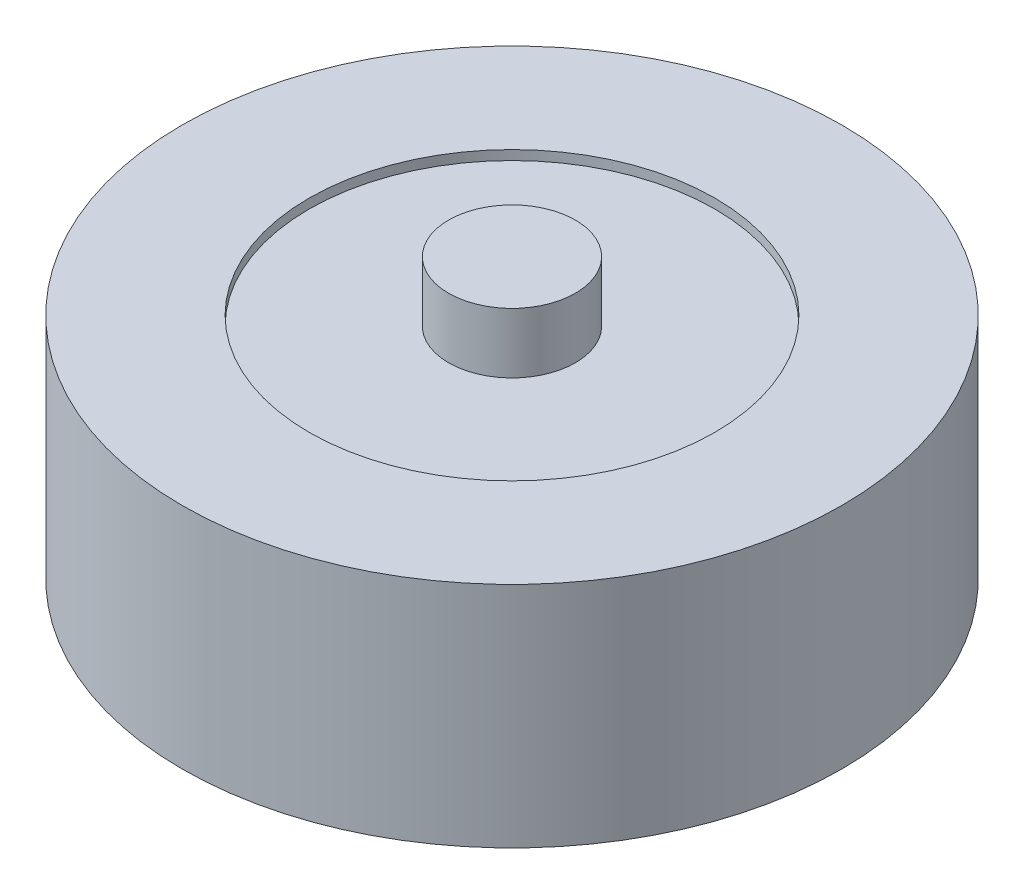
ISO-10303-21;
HEADER;
FILE_DESCRIPTION(('STEP AP214'),'2;1');
FILE_NAME('part.step','',(''),(''),'','','');
FILE_SCHEMA(('AUTOMOTIVE_DESIGN { 1 0 10303 214 1 1 1 1 }'));
ENDSEC;
DATA;
#1=APPLICATION_CONTEXT('core data for automotive mechanical design processes');
#2=APPLICATION_PROTOCOL_DEFINITION('international standard','automotive_design',2000,#1);
#3=PRODUCT_CONTEXT('',#1,'mechanical');
#4=PRODUCT('Part','Part','',(#3));
#5=PRODUCT_RELATED_PRODUCT_CATEGORY('part','',(#4));
#6=PRODUCT_DEFINITION_FORMATION('','',#4);
#7=PRODUCT_DEFINITION_CONTEXT('part definition',#1,'design');
#8=PRODUCT_DEFINITION('design','',#6,#7);
#9=PRODUCT_DEFINITION_SHAPE('','',#8);
#10=(LENGTH_UNIT() NAMED_UNIT(*) SI_UNIT(.MILLI.,.METRE.));
#11=(NAMED_UNIT(*) PLANE_ANGLE_UNIT() SI_UNIT($,.RADIAN.));
#12=(NAMED_UNIT(*) SI_UNIT($,.STERADIAN.) SOLID_ANGLE_UNIT());
#13=UNCERTAINTY_MEASURE_WITH_UNIT(LENGTH_MEASURE(1.E-05),#10,'distance_accuracy_value','');
#14=(GEOMETRIC_REPRESENTATION_CONTEXT(3) GLOBAL_UNCERTAINTY_ASSIGNED_CONTEXT((#13)) GLOBAL_UNIT_ASSIGNED_CONTEXT((#10,
#11,#12)) REPRESENTATION_CONTEXT('',''));
#15=CARTESIAN_POINT('',(0.,0.,0.));
#16=DIRECTION('',(0.,0.,1.));
#17=DIRECTION('',(1.,0.,0.));
#18=AXIS2_PLACEMENT_3D('',#15,#16,#17);
#19=CARTESIAN_POINT('',(0.,17.25,0.));
#20=DIRECTION('',(0.,1.,0.));
#21=DIRECTION('',(0.,0.,1.));
#22=AXIS2_PLACEMENT_3D('',#19,#20,#21);
#23=PLANE('',#22);
#24=CARTESIAN_POINT('',(0.,17.25,0.));
#25=DIRECTION('',(0.,1.,0.));
#26=DIRECTION('',(0.,0.,1.));
#27=AXIS2_PLACEMENT_3D('',#24,#25,#26);
#28=CIRCLE('',#27,16.);
#29=CARTESIAN_POINT('',(0.,17.25,16.));
#30=VERTEX_POINT('',#29);
#31=EDGE_CURVE('E93',#30,#30,#28,.T.);
#32=ORIENTED_EDGE('',*,*,#31,.T.);
#33=EDGE_LOOP('',(#32));
#34=FACE_BOUND('',#33,.T.);
#35=CARTESIAN_POINT('',(0.,17.25,0.));
#36=DIRECTION('',(0.,1.,0.));
#37=DIRECTION('',(0.,0.,1.));
#38=AXIS2_PLACEMENT_3D('',#35,#36,#37);
#39=CIRCLE('',#38,5.);
#40=CARTESIAN_POINT('',(0.,17.25,5.));
#41=VERTEX_POINT('',#40);
#42=EDGE_CURVE('E86',#41,#41,#39,.T.);
#43=ORIENTED_EDGE('',*,*,#42,.F.);
#44=EDGE_LOOP('',(#43));
#45=FACE_BOUND('',#44,.T.);
#46=ADVANCED_FACE('F32',(#34,#45),#23,.T.);
#47=CARTESIAN_POINT('',(0.,18.,0.));
#48=DIRECTION('',(0.,-1.,0.));
#49=DIRECTION('',(0.,0.,-1.));
#50=AXIS2_PLACEMENT_3D('',#47,#48,#49);
#51=CYLINDRICAL_SURFACE('',#50,26.);
#52=CARTESIAN_POINT('',(0.,18.,0.));
#53=DIRECTION('',(0.,1.,0.));
#54=DIRECTION('',(0.,0.,1.));
#55=AXIS2_PLACEMENT_3D('',#52,#53,#54);
#56=CIRCLE('',#55,26.);
#57=CARTESIAN_POINT('',(0.,18.,26.));
#58=VERTEX_POINT('',#57);
#59=EDGE_CURVE('E11',#58,#58,#56,.T.);
#60=ORIENTED_EDGE('',*,*,#59,.F.);
#61=EDGE_LOOP('',(#60));
#62=FACE_BOUND('',#61,.T.);
#63=CARTESIAN_POINT('',(0.,0.,0.));
#64=DIRECTION('',(0.,1.,0.));
#65=DIRECTION('',(0.,0.,1.));
#66=AXIS2_PLACEMENT_3D('',#63,#64,#65);
#67=CIRCLE('',#66,26.);
#68=CARTESIAN_POINT('',(0.,0.,26.));
#69=VERTEX_POINT('',#68);
#70=EDGE_CURVE('E36',#69,#69,#67,.T.);
#71=ORIENTED_EDGE('',*,*,#70,.T.);
#72=EDGE_LOOP('',(#71));
#73=FACE_BOUND('',#72,.T.);
#74=ADVANCED_FACE('F34',(#62,#73),#51,.T.);
#75=CARTESIAN_POINT('',(0.,18.,0.));
#76=DIRECTION('',(0.,1.,0.));
#77=DIRECTION('',(0.,0.,1.));
#78=AXIS2_PLACEMENT_3D('',#75,#76,#77);
#79=PLANE('',#78);
#80=CARTESIAN_POINT('',(0.,18.,0.));
#81=DIRECTION('',(0.,1.,0.));
#82=DIRECTION('',(0.,0.,1.));
#83=AXIS2_PLACEMENT_3D('',#80,#81,#82);
#84=CIRCLE('',#83,16.);
#85=CARTESIAN_POINT('',(0.,18.,16.));
#86=VERTEX_POINT('',#85);
#87=EDGE_CURVE('E90',#86,#86,#84,.T.);
#88=ORIENTED_EDGE('',*,*,#87,.F.);
#89=EDGE_LOOP('',(#88));
#90=FACE_BOUND('',#89,.T.);
#91=ORIENTED_EDGE('',*,*,#59,.T.);
#92=EDGE_LOOP('',(#91));
#93=FACE_BOUND('',#92,.T.);
#94=ADVANCED_FACE('F101',(#90,#93),#79,.T.);
#95=CARTESIAN_POINT('',(0.,0.,0.));
#96=DIRECTION('',(0.,1.,0.));
#97=DIRECTION('',(0.,0.,1.));
#98=AXIS2_PLACEMENT_3D('',#95,#96,#97);
#99=PLANE('',#98);
#100=CARTESIAN_POINT('',(-15.5563491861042,0.,15.5563491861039));
#101=DIRECTION('',(0.,-1.,0.));
#102=DIRECTION('',(0.,0.,-1.));
#103=AXIS2_PLACEMENT_3D('',#100,#101,#102);
#104=CIRCLE('',#103,2.09999999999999);
#105=CARTESIAN_POINT('',(-15.5563491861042,0.,13.4563491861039));
#106=VERTEX_POINT('',#105);
#107=EDGE_CURVE('E64',#106,#106,#104,.T.);
#108=ORIENTED_EDGE('',*,*,#107,.F.);
#109=EDGE_LOOP('',(#108));
#110=FACE_BOUND('',#109,.T.);
#111=CARTESIAN_POINT('',(15.556349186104,0.,15.5563491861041));
#112=DIRECTION('',(0.,-1.,0.));
#113=DIRECTION('',(0.,0.,-1.));
#114=AXIS2_PLACEMENT_3D('',#111,#112,#113);
#115=CIRCLE('',#114,2.09999999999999);
#116=CARTESIAN_POINT('',(15.556349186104,0.,13.4563491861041));
#117=VERTEX_POINT('',#116);
#118=EDGE_CURVE('E63',#117,#117,#115,.T.);
#119=ORIENTED_EDGE('',*,*,#118,.F.);
#120=EDGE_LOOP('',(#119));
#121=FACE_BOUND('',#120,.T.);
#122=CARTESIAN_POINT('',(15.5563491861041,0.,-15.556349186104));
#123=DIRECTION('',(0.,-1.,0.));
#124=DIRECTION('',(0.,0.,-1.));
#125=AXIS2_PLACEMENT_3D('',#122,#123,#124);
#126=CIRCLE('',#125,2.09999999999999);
#127=CARTESIAN_POINT('',(15.5563491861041,0.,-17.656349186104));
#128=VERTEX_POINT('',#127);
#129=EDGE_CURVE('E74',#128,#128,#126,.T.);
#130=ORIENTED_EDGE('',*,*,#129,.F.);
#131=EDGE_LOOP('',(#130));
#132=FACE_BOUND('',#131,.T.);
#133=CARTESIAN_POINT('',(-15.5563491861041,0.,-15.556349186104));
#134=DIRECTION('',(0.,-1.,0.));
#135=DIRECTION('',(0.,0.,-1.));
#136=AXIS2_PLACEMENT_3D('',#133,#134,#135);
#137=CIRCLE('',#136,2.09999999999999);
#138=CARTESIAN_POINT('',(-15.5563491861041,0.,-17.656349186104));
#139=VERTEX_POINT('',#138);
#140=EDGE_CURVE('E80',#139,#139,#137,.T.);
#141=ORIENTED_EDGE('',*,*,#140,.F.);
#142=EDGE_LOOP('',(#141));
#143=FACE_BOUND('',#142,.T.);
#144=ORIENTED_EDGE('',*,*,#70,.F.);
#145=EDGE_LOOP('',(#144));
#146=FACE_BOUND('',#145,.T.);
#147=ADVANCED_FACE('F104',(#110,#121,#132,#143,#146),#99,.F.);
#148=CARTESIAN_POINT('',(0.,17.25,0.));
#149=DIRECTION('',(0.,1.,0.));
#150=DIRECTION('',(0.,0.,1.));
#151=AXIS2_PLACEMENT_3D('',#148,#149,#150);
#152=CYLINDRICAL_SURFACE('',#151,16.);
#153=ORIENTED_EDGE('',*,*,#31,.F.);
#154=EDGE_LOOP('',(#153));
#155=FACE_BOUND('',#154,.T.);
#156=ORIENTED_EDGE('',*,*,#87,.T.);
#157=EDGE_LOOP('',(#156));
#158=FACE_BOUND('',#157,.T.);
#159=ADVANCED_FACE('F99',(#155,#158),#152,.F.);
#160=CARTESIAN_POINT('',(0.,22.,0.));
#161=DIRECTION('',(0.,-1.,0.));
#162=DIRECTION('',(0.,0.,-1.));
#163=AXIS2_PLACEMENT_3D('',#160,#161,#162);
#164=CYLINDRICAL_SURFACE('',#163,5.);
#165=CARTESIAN_POINT('',(0.,22.,0.));
#166=DIRECTION('',(0.,1.,0.));
#167=DIRECTION('',(0.,0.,1.));
#168=AXIS2_PLACEMENT_3D('',#165,#166,#167);
#169=CIRCLE('',#168,5.);
#170=CARTESIAN_POINT('',(0.,22.,5.));
#171=VERTEX_POINT('',#170);
#172=EDGE_CURVE('E87',#171,#171,#169,.T.);
#173=ORIENTED_EDGE('',*,*,#172,.F.);
#174=EDGE_LOOP('',(#173));
#175=FACE_BOUND('',#174,.T.);
#176=ORIENTED_EDGE('',*,*,#42,.T.);
#177=EDGE_LOOP('',(#176));
#178=FACE_BOUND('',#177,.T.);
#179=ADVANCED_FACE('F118',(#175,#178),#164,.T.);
#180=CARTESIAN_POINT('',(0.,22.,0.));
#181=DIRECTION('',(0.,1.,0.));
#182=DIRECTION('',(0.,0.,1.));
#183=AXIS2_PLACEMENT_3D('',#180,#181,#182);
#184=PLANE('',#183);
#185=ORIENTED_EDGE('',*,*,#172,.T.);
#186=EDGE_LOOP('',(#185));
#187=FACE_BOUND('',#186,.T.);
#188=ADVANCED_FACE('F132',(#187),#184,.T.);
#189=CARTESIAN_POINT('',(-15.5563491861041,10.4,-15.556349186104));
#190=DIRECTION('',(0.,-1.,0.));
#191=DIRECTION('',(0.,0.,-1.));
#192=AXIS2_PLACEMENT_3D('',#189,#190,#191);
#193=CONICAL_SURFACE('',#192,2.09999999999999,1.02974425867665);
#194=CARTESIAN_POINT('',(-15.5563491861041,11.6618072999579,-15.556349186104));
#195=VERTEX_POINT('',#194);
#196=VERTEX_LOOP('',#195);
#197=FACE_BOUND('',#196,.T.);
#198=CARTESIAN_POINT('',(-15.5563491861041,10.4,-15.556349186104));
#199=DIRECTION('',(0.,-1.,0.));
#200=DIRECTION('',(0.,0.,-1.));
#201=AXIS2_PLACEMENT_3D('',#198,#199,#200);
#202=CIRCLE('',#201,2.09999999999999);
#203=CARTESIAN_POINT('',(-15.5563491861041,10.4,-17.656349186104));
#204=VERTEX_POINT('',#203);
#205=EDGE_CURVE('E83',#204,#204,#202,.T.);
#206=ORIENTED_EDGE('',*,*,#205,.T.);
#207=EDGE_LOOP('',(#206));
#208=FACE_BOUND('',#207,.T.);
#209=ADVANCED_FACE('F136',(#197,#208),#193,.F.);
#210=CARTESIAN_POINT('',(-15.5563491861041,0.,-15.556349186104));
#211=DIRECTION('',(0.,-1.,0.));
#212=DIRECTION('',(0.,0.,-1.));
#213=AXIS2_PLACEMENT_3D('',#210,#211,#212);
#214=CYLINDRICAL_SURFACE('',#213,2.09999999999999);
#215=ORIENTED_EDGE('',*,*,#205,.F.);
#216=EDGE_LOOP('',(#215));
#217=FACE_BOUND('',#216,.T.);
#218=ORIENTED_EDGE('',*,*,#140,.T.);
#219=EDGE_LOOP('',(#218));
#220=FACE_BOUND('',#219,.T.);
#221=ADVANCED_FACE('F140',(#217,#220),#214,.F.);
#222=CARTESIAN_POINT('',(15.5563491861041,10.4,-15.556349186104));
#223=DIRECTION('',(0.,-1.,0.));
#224=DIRECTION('',(0.,0.,-1.));
#225=AXIS2_PLACEMENT_3D('',#222,#223,#224);
#226=CONICAL_SURFACE('',#225,2.09999999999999,1.02974425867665);
#227=CARTESIAN_POINT('',(15.5563491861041,11.6618072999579,-15.556349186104));
#228=VERTEX_POINT('',#227);
#229=VERTEX_LOOP('',#228);
#230=FACE_BOUND('',#229,.T.);
#231=CARTESIAN_POINT('',(15.5563491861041,10.4,-15.556349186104));
#232=DIRECTION('',(0.,-1.,0.));
#233=DIRECTION('',(0.,0.,-1.));
#234=AXIS2_PLACEMENT_3D('',#231,#232,#233);
#235=CIRCLE('',#234,2.09999999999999);
#236=CARTESIAN_POINT('',(15.5563491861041,10.4,-17.656349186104));
#237=VERTEX_POINT('',#236);
#238=EDGE_CURVE('E77',#237,#237,#235,.T.);
#239=ORIENTED_EDGE('',*,*,#238,.T.);
#240=EDGE_LOOP('',(#239));
#241=FACE_BOUND('',#240,.T.);
#242=ADVANCED_FACE('F143',(#230,#241),#226,.F.);
#243=CARTESIAN_POINT('',(15.5563491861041,0.,-15.556349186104));
#244=DIRECTION('',(0.,-1.,0.));
#245=DIRECTION('',(0.,0.,-1.));
#246=AXIS2_PLACEMENT_3D('',#243,#244,#245);
#247=CYLINDRICAL_SURFACE('',#246,2.09999999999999);
#248=ORIENTED_EDGE('',*,*,#238,.F.);
#249=EDGE_LOOP('',(#248));
#250=FACE_BOUND('',#249,.T.);
#251=ORIENTED_EDGE('',*,*,#129,.T.);
#252=EDGE_LOOP('',(#251));
#253=FACE_BOUND('',#252,.T.);
#254=ADVANCED_FACE('F147',(#250,#253),#247,.F.);
#255=CARTESIAN_POINT('',(15.556349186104,10.4,15.5563491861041));
#256=DIRECTION('',(0.,-1.,0.));
#257=DIRECTION('',(0.,0.,-1.));
#258=AXIS2_PLACEMENT_3D('',#255,#256,#257);
#259=CONICAL_SURFACE('',#258,2.09999999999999,1.02974425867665);
#260=CARTESIAN_POINT('',(15.556349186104,11.6618072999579,15.5563491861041));
#261=VERTEX_POINT('',#260);
#262=VERTEX_LOOP('',#261);
#263=FACE_BOUND('',#262,.T.);
#264=CARTESIAN_POINT('',(15.556349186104,10.4,15.5563491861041));
#265=DIRECTION('',(0.,-1.,0.));
#266=DIRECTION('',(0.,0.,-1.));
#267=AXIS2_PLACEMENT_3D('',#264,#265,#266);
#268=CIRCLE('',#267,2.09999999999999);
#269=CARTESIAN_POINT('',(15.556349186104,10.4,13.4563491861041));
#270=VERTEX_POINT('',#269);
#271=EDGE_CURVE('E67',#270,#270,#268,.T.);
#272=ORIENTED_EDGE('',*,*,#271,.T.);
#273=EDGE_LOOP('',(#272));
#274=FACE_BOUND('',#273,.T.);
#275=ADVANCED_FACE('F150',(#263,#274),#259,.F.);
#276=CARTESIAN_POINT('',(15.556349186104,0.,15.5563491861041));
#277=DIRECTION('',(0.,-1.,0.));
#278=DIRECTION('',(0.,0.,-1.));
#279=AXIS2_PLACEMENT_3D('',#276,#277,#278);
#280=CYLINDRICAL_SURFACE('',#279,2.09999999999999);
#281=ORIENTED_EDGE('',*,*,#271,.F.);
#282=EDGE_LOOP('',(#281));
#283=FACE_BOUND('',#282,.T.);
#284=ORIENTED_EDGE('',*,*,#118,.T.);
#285=EDGE_LOOP('',(#284));
#286=FACE_BOUND('',#285,.T.);
#287=ADVANCED_FACE('F57',(#283,#286),#280,.F.);
#288=CARTESIAN_POINT('',(-15.5563491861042,10.4,15.5563491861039));
#289=DIRECTION('',(0.,-1.,0.));
#290=DIRECTION('',(0.,0.,-1.));
#291=AXIS2_PLACEMENT_3D('',#288,#289,#290);
#292=CONICAL_SURFACE('',#291,2.09999999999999,1.02974425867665);
#293=CARTESIAN_POINT('',(-15.5563491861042,11.6618072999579,15.5563491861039));
#294=VERTEX_POINT('',#293);
#295=VERTEX_LOOP('',#294);
#296=FACE_BOUND('',#295,.T.);
#297=CARTESIAN_POINT('',(-15.5563491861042,10.4,15.5563491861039));
#298=DIRECTION('',(0.,-1.,0.));
#299=DIRECTION('',(0.,0.,-1.));
#300=AXIS2_PLACEMENT_3D('',#297,#298,#299);
#301=CIRCLE('',#300,2.09999999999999);
#302=CARTESIAN_POINT('',(-15.5563491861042,10.4,13.4563491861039));
#303=VERTEX_POINT('',#302);
#304=EDGE_CURVE('E61',#303,#303,#301,.T.);
#305=ORIENTED_EDGE('',*,*,#304,.T.);
#306=EDGE_LOOP('',(#305));
#307=FACE_BOUND('',#306,.T.);
#308=ADVANCED_FACE('F53',(#296,#307),#292,.F.);
#309=CARTESIAN_POINT('',(-15.5563491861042,0.,15.5563491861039));
#310=DIRECTION('',(0.,-1.,0.));
#311=DIRECTION('',(0.,0.,-1.));
#312=AXIS2_PLACEMENT_3D('',#309,#310,#311);
#313=CYLINDRICAL_SURFACE('',#312,2.09999999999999);
#314=ORIENTED_EDGE('',*,*,#304,.F.);
#315=EDGE_LOOP('',(#314));
#316=FACE_BOUND('',#315,.T.);
#317=ORIENTED_EDGE('',*,*,#107,.T.);
#318=EDGE_LOOP('',(#317));
#319=FACE_BOUND('',#318,.T.);
#320=ADVANCED_FACE('F56',(#316,#319),#313,.F.);
#321=CLOSED_SHELL('',(#46,#74,#94,#147,#159,#179,#188,#209,#221,#242,#254,#275,#287,#308,#320));
#322=MANIFOLD_SOLID_BREP('B2',#321);
#323=ADVANCED_BREP_SHAPE_REPRESENTATION('',(#18,#322),#14);
#324=SHAPE_DEFINITION_REPRESENTATION(#9,#323);
ENDSEC;
END-ISO-10303-21;
